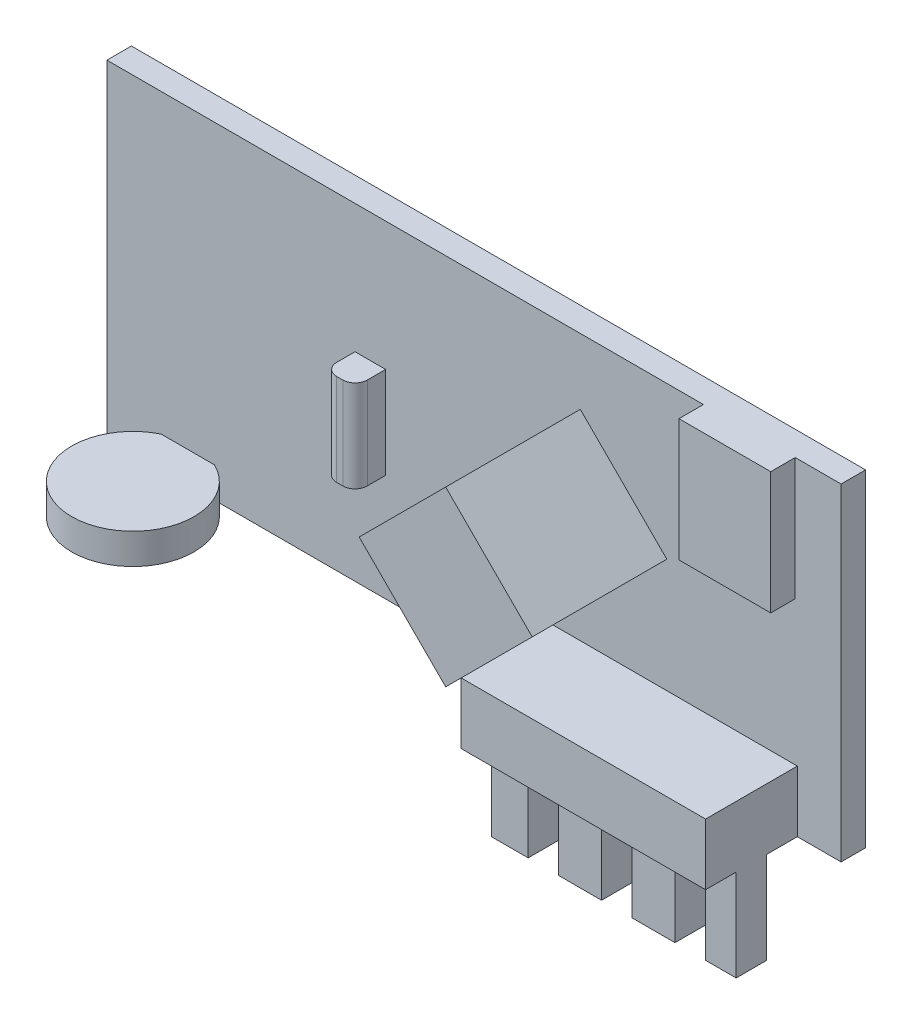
ISO-10303-21;
HEADER;
FILE_DESCRIPTION(('STEP AP214'),'2;1');
FILE_NAME('part.step','',(''),(''),'','','');
FILE_SCHEMA(('AUTOMOTIVE_DESIGN { 1 0 10303 214 1 1 1 1 }'));
ENDSEC;
DATA;
#1=APPLICATION_CONTEXT('core data for automotive mechanical design processes');
#2=APPLICATION_PROTOCOL_DEFINITION('international standard','automotive_design',2000,#1);
#3=PRODUCT_CONTEXT('',#1,'mechanical');
#4=PRODUCT('Part','Part','',(#3));
#5=PRODUCT_RELATED_PRODUCT_CATEGORY('part','',(#4));
#6=PRODUCT_DEFINITION_FORMATION('','',#4);
#7=PRODUCT_DEFINITION_CONTEXT('part definition',#1,'design');
#8=PRODUCT_DEFINITION('design','',#6,#7);
#9=PRODUCT_DEFINITION_SHAPE('','',#8);
#10=(LENGTH_UNIT() NAMED_UNIT(*) SI_UNIT(.MILLI.,.METRE.));
#11=(NAMED_UNIT(*) PLANE_ANGLE_UNIT() SI_UNIT($,.RADIAN.));
#12=(NAMED_UNIT(*) SI_UNIT($,.STERADIAN.) SOLID_ANGLE_UNIT());
#13=UNCERTAINTY_MEASURE_WITH_UNIT(LENGTH_MEASURE(1.E-05),#10,'distance_accuracy_value','');
#14=(GEOMETRIC_REPRESENTATION_CONTEXT(3) GLOBAL_UNCERTAINTY_ASSIGNED_CONTEXT((#13)) GLOBAL_UNIT_ASSIGNED_CONTEXT((#10,
#11,#12)) REPRESENTATION_CONTEXT('',''));
#15=CARTESIAN_POINT('',(0.,0.,0.));
#16=DIRECTION('',(0.,0.,1.));
#17=DIRECTION('',(1.,0.,0.));
#18=AXIS2_PLACEMENT_3D('',#15,#16,#17);
#19=CARTESIAN_POINT('',(0.,0.,1.016));
#20=DIRECTION('',(0.,0.,-1.));
#21=DIRECTION('',(-1.,0.,0.));
#22=AXIS2_PLACEMENT_3D('',#19,#20,#21);
#23=PLANE('',#22);
#24=DIRECTION('',(-1.,0.,0.));
#25=VECTOR('',#24,1.);
#26=CARTESIAN_POINT('',(0.,1.27,1.016));
#27=LINE('',#26,#25);
#28=CARTESIAN_POINT('',(4.46998130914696,1.27,1.016));
#29=VERTEX_POINT('',#28);
#30=CARTESIAN_POINT('',(2.2556606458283,1.27,1.016));
#31=VERTEX_POINT('',#30);
#32=EDGE_CURVE('E673',#29,#31,#27,.T.);
#33=ORIENTED_EDGE('',*,*,#32,.F.);
#34=DIRECTION('',(0.,-1.,0.));
#35=VECTOR('',#34,1.);
#36=CARTESIAN_POINT('',(4.46998130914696,1.27,1.016));
#37=LINE('',#36,#35);
#38=CARTESIAN_POINT('',(4.46998130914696,0.,1.016));
#39=VERTEX_POINT('',#38);
#40=EDGE_CURVE('E357',#29,#39,#37,.T.);
#41=ORIENTED_EDGE('',*,*,#40,.T.);
#42=DIRECTION('',(1.,0.,0.));
#43=VECTOR('',#42,1.);
#44=CARTESIAN_POINT('',(0.,0.,1.016));
#45=LINE('',#44,#43);
#46=CARTESIAN_POINT('',(18.5036867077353,0.,1.016));
#47=VERTEX_POINT('',#46);
#48=EDGE_CURVE('E611',#39,#47,#45,.T.);
#49=ORIENTED_EDGE('',*,*,#48,.T.);
#50=DIRECTION('',(0.,-1.,0.));
#51=VECTOR('',#50,1.);
#52=CARTESIAN_POINT('',(18.5036867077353,-3.81,1.016));
#53=LINE('',#52,#51);
#54=CARTESIAN_POINT('',(18.5036867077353,2.54,1.016));
#55=VERTEX_POINT('',#54);
#56=EDGE_CURVE('E476',#55,#47,#53,.T.);
#57=ORIENTED_EDGE('',*,*,#56,.F.);
#58=DIRECTION('',(-1.,0.,0.));
#59=VECTOR('',#58,1.);
#60=CARTESIAN_POINT('',(18.5036867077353,2.54,1.016));
#61=LINE('',#60,#59);
#62=CARTESIAN_POINT('',(28.6636867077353,2.54,1.016));
#63=VERTEX_POINT('',#62);
#64=EDGE_CURVE('E482',#63,#55,#61,.T.);
#65=ORIENTED_EDGE('',*,*,#64,.F.);
#66=DIRECTION('',(0.,1.,0.));
#67=VECTOR('',#66,1.);
#68=CARTESIAN_POINT('',(28.6636867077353,-3.81,1.016));
#69=LINE('',#68,#67);
#70=CARTESIAN_POINT('',(28.6636867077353,0.,1.016));
#71=VERTEX_POINT('',#70);
#72=EDGE_CURVE('E492',#71,#63,#69,.T.);
#73=ORIENTED_EDGE('',*,*,#72,.F.);
#74=CARTESIAN_POINT('',(30.48,0.,1.016));
#75=VERTEX_POINT('',#74);
#76=EDGE_CURVE('E605',#71,#75,#45,.T.);
#77=ORIENTED_EDGE('',*,*,#76,.T.);
#78=DIRECTION('',(0.,1.,0.));
#79=VECTOR('',#78,1.);
#80=CARTESIAN_POINT('',(30.48,0.,1.016));
#81=LINE('',#80,#79);
#82=CARTESIAN_POINT('',(30.48,13.589,1.016));
#83=VERTEX_POINT('',#82);
#84=EDGE_CURVE('E610',#75,#83,#81,.T.);
#85=ORIENTED_EDGE('',*,*,#84,.T.);
#86=DIRECTION('',(-1.,0.,0.));
#87=VECTOR('',#86,1.);
#88=CARTESIAN_POINT('',(0.,13.589,1.016));
#89=LINE('',#88,#87);
#90=CARTESIAN_POINT('',(28.575,13.589,1.016));
#91=VERTEX_POINT('',#90);
#92=EDGE_CURVE('E615',#83,#91,#89,.T.);
#93=ORIENTED_EDGE('',*,*,#92,.T.);
#94=DIRECTION('',(0.,1.,0.));
#95=VECTOR('',#94,1.);
#96=CARTESIAN_POINT('',(28.575,13.589,1.016));
#97=LINE('',#96,#95);
#98=CARTESIAN_POINT('',(28.575,8.509,1.016));
#99=VERTEX_POINT('',#98);
#100=EDGE_CURVE('E565',#99,#91,#97,.T.);
#101=ORIENTED_EDGE('',*,*,#100,.F.);
#102=DIRECTION('',(1.,0.,0.));
#103=VECTOR('',#102,1.);
#104=CARTESIAN_POINT('',(24.765,8.509,1.016));
#105=LINE('',#104,#103);
#106=CARTESIAN_POINT('',(24.765,8.509,1.016));
#107=VERTEX_POINT('',#106);
#108=EDGE_CURVE('E578',#107,#99,#105,.T.);
#109=ORIENTED_EDGE('',*,*,#108,.F.);
#110=DIRECTION('',(0.,-1.,0.));
#111=VECTOR('',#110,1.);
#112=CARTESIAN_POINT('',(24.765,13.589,1.016));
#113=LINE('',#112,#111);
#114=CARTESIAN_POINT('',(24.765,13.589,1.016));
#115=VERTEX_POINT('',#114);
#116=EDGE_CURVE('E559',#115,#107,#113,.T.);
#117=ORIENTED_EDGE('',*,*,#116,.F.);
#118=CARTESIAN_POINT('',(0.,13.589,1.016));
#119=VERTEX_POINT('',#118);
#120=EDGE_CURVE('E614',#115,#119,#89,.T.);
#121=ORIENTED_EDGE('',*,*,#120,.T.);
#122=DIRECTION('',(0.,-1.,0.));
#123=VECTOR('',#122,1.);
#124=CARTESIAN_POINT('',(0.,0.,1.016));
#125=LINE('',#124,#123);
#126=CARTESIAN_POINT('',(0.,0.,1.016));
#127=VERTEX_POINT('',#126);
#128=EDGE_CURVE('E601',#119,#127,#125,.T.);
#129=ORIENTED_EDGE('',*,*,#128,.T.);
#130=CARTESIAN_POINT('',(2.2556606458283,0.,1.016));
#131=VERTEX_POINT('',#130);
#132=EDGE_CURVE('E607',#127,#131,#45,.T.);
#133=ORIENTED_EDGE('',*,*,#132,.T.);
#134=DIRECTION('',(0.,-1.,0.));
#135=VECTOR('',#134,1.);
#136=CARTESIAN_POINT('',(2.2556606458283,1.27,1.016));
#137=LINE('',#136,#135);
#138=EDGE_CURVE('E351',#131,#31,#137,.F.);
#139=ORIENTED_EDGE('',*,*,#138,.T.);
#140=EDGE_LOOP('',(#33,#41,#49,#57,#65,#73,#77,#85,#93,#101,#109,#117,#121,#129,#133,#139));
#141=FACE_BOUND('',#140,.T.);
#142=DIRECTION('',(0.707106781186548,-0.707106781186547,0.));
#143=VECTOR('',#142,1.);
#144=CARTESIAN_POINT('',(16.0610746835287,7.2682871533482,1.016));
#145=LINE('',#144,#143);
#146=CARTESIAN_POINT('',(16.0610746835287,7.2682871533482,1.016));
#147=VERTEX_POINT('',#146);
#148=CARTESIAN_POINT('',(19.6531771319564,3.67618470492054,1.016));
#149=VERTEX_POINT('',#148);
#150=EDGE_CURVE('E514',#147,#149,#145,.T.);
#151=ORIENTED_EDGE('',*,*,#150,.F.);
#152=DIRECTION('',(-0.707106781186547,-0.707106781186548,0.));
#153=VECTOR('',#152,1.);
#154=CARTESIAN_POINT('',(19.6531771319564,10.8603896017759,1.016));
#155=LINE('',#154,#153);
#156=CARTESIAN_POINT('',(19.6531771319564,10.8603896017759,1.016));
#157=VERTEX_POINT('',#156);
#158=EDGE_CURVE('E520',#157,#147,#155,.T.);
#159=ORIENTED_EDGE('',*,*,#158,.F.);
#160=DIRECTION('',(-0.707106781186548,0.707106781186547,0.));
#161=VECTOR('',#160,1.);
#162=CARTESIAN_POINT('',(23.245279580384,7.2682871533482,1.016));
#163=LINE('',#162,#161);
#164=CARTESIAN_POINT('',(23.245279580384,7.2682871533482,1.016));
#165=VERTEX_POINT('',#164);
#166=EDGE_CURVE('E537',#165,#157,#163,.T.);
#167=ORIENTED_EDGE('',*,*,#166,.F.);
#168=DIRECTION('',(0.707106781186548,0.707106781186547,0.));
#169=VECTOR('',#168,1.);
#170=CARTESIAN_POINT('',(19.6531771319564,3.67618470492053,1.016));
#171=LINE('',#170,#169);
#172=EDGE_CURVE('E533',#149,#165,#171,.T.);
#173=ORIENTED_EDGE('',*,*,#172,.F.);
#174=EDGE_LOOP('',(#151,#159,#167,#173));
#175=FACE_BOUND('',#174,.T.);
#176=DIRECTION('',(0.,1.,0.));
#177=VECTOR('',#176,1.);
#178=CARTESIAN_POINT('',(11.5708707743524,8.255,1.016));
#179=LINE('',#178,#177);
#180=CARTESIAN_POINT('',(11.5708707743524,4.445,1.016));
#181=VERTEX_POINT('',#180);
#182=CARTESIAN_POINT('',(11.5708707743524,8.255,1.016));
#183=VERTEX_POINT('',#182);
#184=EDGE_CURVE('E306',#181,#183,#179,.T.);
#185=ORIENTED_EDGE('',*,*,#184,.F.);
#186=DIRECTION('',(1.,0.,0.));
#187=VECTOR('',#186,1.);
#188=CARTESIAN_POINT('',(10.3008707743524,4.445,1.016));
#189=LINE('',#188,#187);
#190=CARTESIAN_POINT('',(10.3008707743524,4.445,1.016));
#191=VERTEX_POINT('',#190);
#192=EDGE_CURVE('E319',#191,#181,#189,.T.);
#193=ORIENTED_EDGE('',*,*,#192,.F.);
#194=DIRECTION('',(0.,-1.,0.));
#195=VECTOR('',#194,1.);
#196=CARTESIAN_POINT('',(10.3008707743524,8.255,1.016));
#197=LINE('',#196,#195);
#198=CARTESIAN_POINT('',(10.3008707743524,8.255,1.016));
#199=VERTEX_POINT('',#198);
#200=EDGE_CURVE('E329',#199,#191,#197,.T.);
#201=ORIENTED_EDGE('',*,*,#200,.F.);
#202=DIRECTION('',(-1.,0.,0.));
#203=VECTOR('',#202,1.);
#204=CARTESIAN_POINT('',(10.3008707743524,8.255,1.016));
#205=LINE('',#204,#203);
#206=EDGE_CURVE('E322',#183,#199,#205,.T.);
#207=ORIENTED_EDGE('',*,*,#206,.F.);
#208=EDGE_LOOP('',(#185,#193,#201,#207));
#209=FACE_BOUND('',#208,.T.);
#210=ADVANCED_FACE('F45',(#141,#175,#209),#23,.F.);
#211=CARTESIAN_POINT('',(18.5036867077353,-3.81,4.826));
#212=DIRECTION('',(0.,1.,0.));
#213=DIRECTION('',(0.,0.,1.));
#214=AXIS2_PLACEMENT_3D('',#211,#212,#213);
#215=PLANE('',#214);
#216=DIRECTION('',(1.,0.,0.));
#217=VECTOR('',#216,1.);
#218=CARTESIAN_POINT('',(14.4396867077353,-3.81,2.286));
#219=LINE('',#218,#217);
#220=CARTESIAN_POINT('',(18.5036867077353,-3.81,2.286));
#221=VERTEX_POINT('',#220);
#222=CARTESIAN_POINT('',(20.0276867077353,-3.81,2.286));
#223=VERTEX_POINT('',#222);
#224=EDGE_CURVE('E450',#221,#223,#219,.T.);
#225=ORIENTED_EDGE('',*,*,#224,.T.);
#226=DIRECTION('',(0.,0.,1.));
#227=VECTOR('',#226,1.);
#228=CARTESIAN_POINT('',(20.0276867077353,-3.81,-10.668));
#229=LINE('',#228,#227);
#230=CARTESIAN_POINT('',(20.0276867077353,-3.81,3.556));
#231=VERTEX_POINT('',#230);
#232=EDGE_CURVE('E370',#223,#231,#229,.T.);
#233=ORIENTED_EDGE('',*,*,#232,.T.);
#234=DIRECTION('',(1.,0.,0.));
#235=VECTOR('',#234,1.);
#236=CARTESIAN_POINT('',(14.4396867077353,-3.81,3.556));
#237=LINE('',#236,#235);
#238=CARTESIAN_POINT('',(18.5036867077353,-3.81,3.556));
#239=VERTEX_POINT('',#238);
#240=EDGE_CURVE('E438',#239,#231,#237,.T.);
#241=ORIENTED_EDGE('',*,*,#240,.F.);
#242=DIRECTION('',(0.,0.,-1.));
#243=VECTOR('',#242,1.);
#244=CARTESIAN_POINT('',(18.5036867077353,-3.81,4.826));
#245=LINE('',#244,#243);
#246=EDGE_CURVE('E510',#239,#221,#245,.T.);
#247=ORIENTED_EDGE('',*,*,#246,.T.);
#248=EDGE_LOOP('',(#225,#233,#241,#247));
#249=FACE_BOUND('',#248,.T.);
#250=ADVANCED_FACE('F714',(#249),#215,.F.);
#251=CARTESIAN_POINT('',(21.2976867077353,-3.81,3.556));
#252=VERTEX_POINT('',#251);
#253=CARTESIAN_POINT('',(23.0756867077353,-3.81,3.556));
#254=VERTEX_POINT('',#253);
#255=EDGE_CURVE('E442',#252,#254,#237,.T.);
#256=ORIENTED_EDGE('',*,*,#255,.F.);
#257=DIRECTION('',(0.,0.,1.));
#258=VECTOR('',#257,1.);
#259=CARTESIAN_POINT('',(21.2976867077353,-3.81,-10.668));
#260=LINE('',#259,#258);
#261=CARTESIAN_POINT('',(21.2976867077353,-3.81,2.286));
#262=VERTEX_POINT('',#261);
#263=EDGE_CURVE('E378',#262,#252,#260,.T.);
#264=ORIENTED_EDGE('',*,*,#263,.F.);
#265=CARTESIAN_POINT('',(23.0756867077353,-3.81,2.286));
#266=VERTEX_POINT('',#265);
#267=EDGE_CURVE('E454',#262,#266,#219,.T.);
#268=ORIENTED_EDGE('',*,*,#267,.T.);
#269=DIRECTION('',(0.,0.,1.));
#270=VECTOR('',#269,1.);
#271=CARTESIAN_POINT('',(23.0756867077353,-3.81,-10.668));
#272=LINE('',#271,#270);
#273=EDGE_CURVE('E384',#266,#254,#272,.T.);
#274=ORIENTED_EDGE('',*,*,#273,.T.);
#275=EDGE_LOOP('',(#256,#264,#268,#274));
#276=FACE_BOUND('',#275,.T.);
#277=ADVANCED_FACE('F722',(#276),#215,.F.);
#278=CARTESIAN_POINT('',(24.3456867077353,-3.81,3.556));
#279=VERTEX_POINT('',#278);
#280=CARTESIAN_POINT('',(26.1236867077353,-3.81,3.556));
#281=VERTEX_POINT('',#280);
#282=EDGE_CURVE('E803',#279,#281,#237,.T.);
#283=ORIENTED_EDGE('',*,*,#282,.F.);
#284=DIRECTION('',(0.,0.,1.));
#285=VECTOR('',#284,1.);
#286=CARTESIAN_POINT('',(24.3456867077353,-3.81,-10.668));
#287=LINE('',#286,#285);
#288=CARTESIAN_POINT('',(24.3456867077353,-3.81,2.286));
#289=VERTEX_POINT('',#288);
#290=EDGE_CURVE('E389',#289,#279,#287,.T.);
#291=ORIENTED_EDGE('',*,*,#290,.F.);
#292=CARTESIAN_POINT('',(26.1236867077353,-3.81,2.286));
#293=VERTEX_POINT('',#292);
#294=EDGE_CURVE('E840',#289,#293,#219,.T.);
#295=ORIENTED_EDGE('',*,*,#294,.T.);
#296=DIRECTION('',(0.,0.,1.));
#297=VECTOR('',#296,1.);
#298=CARTESIAN_POINT('',(26.1236867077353,-3.81,-10.668));
#299=LINE('',#298,#297);
#300=EDGE_CURVE('E404',#293,#281,#299,.T.);
#301=ORIENTED_EDGE('',*,*,#300,.T.);
#302=EDGE_LOOP('',(#283,#291,#295,#301));
#303=FACE_BOUND('',#302,.T.);
#304=ADVANCED_FACE('F847',(#303),#215,.F.);
#305=CARTESIAN_POINT('',(14.4396867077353,-3.81,3.556));
#306=DIRECTION('',(0.,0.,-1.));
#307=DIRECTION('',(-1.,0.,0.));
#308=AXIS2_PLACEMENT_3D('',#305,#306,#307);
#309=PLANE('',#308);
#310=ORIENTED_EDGE('',*,*,#240,.T.);
#311=DIRECTION('',(0.,-1.,0.));
#312=VECTOR('',#311,1.);
#313=CARTESIAN_POINT('',(20.0276867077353,-3.81,3.556));
#314=LINE('',#313,#312);
#315=CARTESIAN_POINT('',(20.0276867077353,0.,3.556));
#316=VERTEX_POINT('',#315);
#317=EDGE_CURVE('E362',#316,#231,#314,.T.);
#318=ORIENTED_EDGE('',*,*,#317,.F.);
#319=DIRECTION('',(1.,0.,0.));
#320=VECTOR('',#319,1.);
#321=CARTESIAN_POINT('',(14.4396867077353,0.,3.556));
#322=LINE('',#321,#320);
#323=CARTESIAN_POINT('',(18.5036867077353,0.,3.556));
#324=VERTEX_POINT('',#323);
#325=EDGE_CURVE('E431',#324,#316,#322,.T.);
#326=ORIENTED_EDGE('',*,*,#325,.F.);
#327=DIRECTION('',(0.,1.,0.));
#328=VECTOR('',#327,1.);
#329=CARTESIAN_POINT('',(18.5036867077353,-3.81,3.556));
#330=LINE('',#329,#328);
#331=EDGE_CURVE('E472',#239,#324,#330,.T.);
#332=ORIENTED_EDGE('',*,*,#331,.F.);
#333=EDGE_LOOP('',(#310,#318,#326,#332));
#334=FACE_BOUND('',#333,.T.);
#335=ADVANCED_FACE('F884',(#334),#309,.F.);
#336=CARTESIAN_POINT('',(21.2976867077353,0.,3.556));
#337=VERTEX_POINT('',#336);
#338=CARTESIAN_POINT('',(23.0756867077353,0.,3.556));
#339=VERTEX_POINT('',#338);
#340=EDGE_CURVE('E436',#337,#339,#322,.T.);
#341=ORIENTED_EDGE('',*,*,#340,.F.);
#342=DIRECTION('',(0.,1.,0.));
#343=VECTOR('',#342,1.);
#344=CARTESIAN_POINT('',(21.2976867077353,-3.81,3.556));
#345=LINE('',#344,#343);
#346=EDGE_CURVE('E365',#252,#337,#345,.T.);
#347=ORIENTED_EDGE('',*,*,#346,.F.);
#348=ORIENTED_EDGE('',*,*,#255,.T.);
#349=DIRECTION('',(0.,-1.,0.));
#350=VECTOR('',#349,1.);
#351=CARTESIAN_POINT('',(23.0756867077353,-3.81,3.556));
#352=LINE('',#351,#350);
#353=EDGE_CURVE('E366',#339,#254,#352,.T.);
#354=ORIENTED_EDGE('',*,*,#353,.F.);
#355=EDGE_LOOP('',(#341,#347,#348,#354));
#356=FACE_BOUND('',#355,.T.);
#357=ADVANCED_FACE('F817',(#356),#309,.F.);
#358=CARTESIAN_POINT('',(24.3456867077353,0.,3.556));
#359=VERTEX_POINT('',#358);
#360=CARTESIAN_POINT('',(26.1236867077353,0.,3.556));
#361=VERTEX_POINT('',#360);
#362=EDGE_CURVE('E797',#359,#361,#322,.T.);
#363=ORIENTED_EDGE('',*,*,#362,.F.);
#364=DIRECTION('',(0.,1.,0.));
#365=VECTOR('',#364,1.);
#366=CARTESIAN_POINT('',(24.3456867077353,-3.81,3.556));
#367=LINE('',#366,#365);
#368=EDGE_CURVE('E388',#279,#359,#367,.T.);
#369=ORIENTED_EDGE('',*,*,#368,.F.);
#370=ORIENTED_EDGE('',*,*,#282,.T.);
#371=DIRECTION('',(0.,-1.,0.));
#372=VECTOR('',#371,1.);
#373=CARTESIAN_POINT('',(26.1236867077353,-3.81,3.556));
#374=LINE('',#373,#372);
#375=EDGE_CURVE('E398',#361,#281,#374,.T.);
#376=ORIENTED_EDGE('',*,*,#375,.F.);
#377=EDGE_LOOP('',(#363,#369,#370,#376));
#378=FACE_BOUND('',#377,.T.);
#379=ADVANCED_FACE('F885',(#378),#309,.F.);
#380=CARTESIAN_POINT('',(14.4396867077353,-3.81,2.286));
#381=DIRECTION('',(0.,0.,1.));
#382=DIRECTION('',(1.,0.,0.));
#383=AXIS2_PLACEMENT_3D('',#380,#381,#382);
#384=PLANE('',#383);
#385=DIRECTION('',(1.,0.,0.));
#386=VECTOR('',#385,1.);
#387=CARTESIAN_POINT('',(14.4396867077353,0.,2.286));
#388=LINE('',#387,#386);
#389=CARTESIAN_POINT('',(18.5036867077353,0.,2.286));
#390=VERTEX_POINT('',#389);
#391=CARTESIAN_POINT('',(20.0276867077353,0.,2.286));
#392=VERTEX_POINT('',#391);
#393=EDGE_CURVE('E443',#390,#392,#388,.T.);
#394=ORIENTED_EDGE('',*,*,#393,.T.);
#395=DIRECTION('',(0.,-1.,0.));
#396=VECTOR('',#395,1.);
#397=CARTESIAN_POINT('',(20.0276867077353,-3.81,2.286));
#398=LINE('',#397,#396);
#399=EDGE_CURVE('E669',#392,#223,#398,.T.);
#400=ORIENTED_EDGE('',*,*,#399,.T.);
#401=ORIENTED_EDGE('',*,*,#224,.F.);
#402=DIRECTION('',(0.,-1.,0.));
#403=VECTOR('',#402,1.);
#404=CARTESIAN_POINT('',(18.5036867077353,-3.81,2.286));
#405=LINE('',#404,#403);
#406=EDGE_CURVE('E468',#390,#221,#405,.T.);
#407=ORIENTED_EDGE('',*,*,#406,.F.);
#408=EDGE_LOOP('',(#394,#400,#401,#407));
#409=FACE_BOUND('',#408,.T.);
#410=ADVANCED_FACE('F888',(#409),#384,.F.);
#411=ORIENTED_EDGE('',*,*,#267,.F.);
#412=DIRECTION('',(0.,1.,0.));
#413=VECTOR('',#412,1.);
#414=CARTESIAN_POINT('',(21.2976867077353,-3.81,2.286));
#415=LINE('',#414,#413);
#416=CARTESIAN_POINT('',(21.2976867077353,0.,2.286));
#417=VERTEX_POINT('',#416);
#418=EDGE_CURVE('E665',#262,#417,#415,.T.);
#419=ORIENTED_EDGE('',*,*,#418,.T.);
#420=CARTESIAN_POINT('',(23.0756867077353,0.,2.286));
#421=VERTEX_POINT('',#420);
#422=EDGE_CURVE('E448',#417,#421,#388,.T.);
#423=ORIENTED_EDGE('',*,*,#422,.T.);
#424=DIRECTION('',(0.,-1.,0.));
#425=VECTOR('',#424,1.);
#426=CARTESIAN_POINT('',(23.0756867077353,-3.81,2.286));
#427=LINE('',#426,#425);
#428=EDGE_CURVE('E661',#421,#266,#427,.T.);
#429=ORIENTED_EDGE('',*,*,#428,.T.);
#430=EDGE_LOOP('',(#411,#419,#423,#429));
#431=FACE_BOUND('',#430,.T.);
#432=ADVANCED_FACE('F754',(#431),#384,.F.);
#433=ORIENTED_EDGE('',*,*,#294,.F.);
#434=DIRECTION('',(0.,1.,0.));
#435=VECTOR('',#434,1.);
#436=CARTESIAN_POINT('',(24.3456867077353,-3.81,2.286));
#437=LINE('',#436,#435);
#438=CARTESIAN_POINT('',(24.3456867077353,0.,2.286));
#439=VERTEX_POINT('',#438);
#440=EDGE_CURVE('E657',#289,#439,#437,.T.);
#441=ORIENTED_EDGE('',*,*,#440,.T.);
#442=CARTESIAN_POINT('',(26.1236867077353,0.,2.286));
#443=VERTEX_POINT('',#442);
#444=EDGE_CURVE('E830',#439,#443,#388,.T.);
#445=ORIENTED_EDGE('',*,*,#444,.T.);
#446=DIRECTION('',(0.,-1.,0.));
#447=VECTOR('',#446,1.);
#448=CARTESIAN_POINT('',(26.1236867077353,-3.81,2.286));
#449=LINE('',#448,#447);
#450=EDGE_CURVE('E653',#443,#293,#449,.T.);
#451=ORIENTED_EDGE('',*,*,#450,.T.);
#452=EDGE_LOOP('',(#433,#441,#445,#451));
#453=FACE_BOUND('',#452,.T.);
#454=ADVANCED_FACE('F749',(#453),#384,.F.);
#455=CARTESIAN_POINT('',(0.,0.,1.016));
#456=DIRECTION('',(1.,0.,0.));
#457=DIRECTION('',(0.,1.,0.));
#458=AXIS2_PLACEMENT_3D('',#455,#456,#457);
#459=PLANE('',#458);
#460=DIRECTION('',(0.,-1.,0.));
#461=VECTOR('',#460,1.);
#462=CARTESIAN_POINT('',(0.,0.,0.));
#463=LINE('',#462,#461);
#464=CARTESIAN_POINT('',(0.,13.589,0.));
#465=VERTEX_POINT('',#464);
#466=CARTESIAN_POINT('',(0.,0.,0.));
#467=VERTEX_POINT('',#466);
#468=EDGE_CURVE('E600',#465,#467,#463,.T.);
#469=ORIENTED_EDGE('',*,*,#468,.T.);
#470=DIRECTION('',(0.,0.,-1.));
#471=VECTOR('',#470,1.);
#472=CARTESIAN_POINT('',(0.,0.,1.016));
#473=LINE('',#472,#471);
#474=EDGE_CURVE('E641',#127,#467,#473,.T.);
#475=ORIENTED_EDGE('',*,*,#474,.F.);
#476=ORIENTED_EDGE('',*,*,#128,.F.);
#477=DIRECTION('',(0.,0.,-1.));
#478=VECTOR('',#477,1.);
#479=CARTESIAN_POINT('',(0.,13.589,1.016));
#480=LINE('',#479,#478);
#481=EDGE_CURVE('E618',#119,#465,#480,.T.);
#482=ORIENTED_EDGE('',*,*,#481,.T.);
#483=EDGE_LOOP('',(#469,#475,#476,#482));
#484=FACE_BOUND('',#483,.T.);
#485=ADVANCED_FACE('F746',(#484),#459,.F.);
#486=CARTESIAN_POINT('',(0.,0.,1.016));
#487=DIRECTION('',(0.,1.,0.));
#488=DIRECTION('',(0.,0.,1.));
#489=AXIS2_PLACEMENT_3D('',#486,#487,#488);
#490=PLANE('',#489);
#491=ORIENTED_EDGE('',*,*,#48,.F.);
#492=CARTESIAN_POINT('',(3.36282097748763,0.,3.302));
#493=DIRECTION('',(0.,-1.,0.));
#494=DIRECTION('',(0.,0.,-1.));
#495=AXIS2_PLACEMENT_3D('',#492,#493,#494);
#496=CIRCLE('',#495,2.54);
#497=EDGE_CURVE('E346',#39,#131,#496,.T.);
#498=ORIENTED_EDGE('',*,*,#497,.T.);
#499=ORIENTED_EDGE('',*,*,#132,.F.);
#500=ORIENTED_EDGE('',*,*,#474,.T.);
#501=DIRECTION('',(1.,0.,0.));
#502=VECTOR('',#501,1.);
#503=CARTESIAN_POINT('',(0.,0.,0.));
#504=LINE('',#503,#502);
#505=CARTESIAN_POINT('',(30.48,0.,0.));
#506=VERTEX_POINT('',#505);
#507=EDGE_CURVE('E622',#467,#506,#504,.T.);
#508=ORIENTED_EDGE('',*,*,#507,.T.);
#509=DIRECTION('',(0.,0.,-1.));
#510=VECTOR('',#509,1.);
#511=CARTESIAN_POINT('',(30.48,0.,1.016));
#512=LINE('',#511,#510);
#513=EDGE_CURVE('E637',#75,#506,#512,.T.);
#514=ORIENTED_EDGE('',*,*,#513,.F.);
#515=ORIENTED_EDGE('',*,*,#76,.F.);
#516=DIRECTION('',(0.,0.,1.));
#517=VECTOR('',#516,1.);
#518=CARTESIAN_POINT('',(28.6636867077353,0.,1.016));
#519=LINE('',#518,#517);
#520=CARTESIAN_POINT('',(28.6636867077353,0.,2.286));
#521=VERTEX_POINT('',#520);
#522=EDGE_CURVE('E427',#71,#521,#519,.T.);
#523=ORIENTED_EDGE('',*,*,#522,.T.);
#524=CARTESIAN_POINT('',(27.3936867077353,0.,2.286));
#525=VERTEX_POINT('',#524);
#526=EDGE_CURVE('E449',#525,#521,#388,.T.);
#527=ORIENTED_EDGE('',*,*,#526,.F.);
#528=DIRECTION('',(0.,0.,1.));
#529=VECTOR('',#528,1.);
#530=CARTESIAN_POINT('',(27.3936867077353,0.,-10.668));
#531=LINE('',#530,#529);
#532=CARTESIAN_POINT('',(27.3936867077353,0.,3.556));
#533=VERTEX_POINT('',#532);
#534=EDGE_CURVE('E412',#525,#533,#531,.T.);
#535=ORIENTED_EDGE('',*,*,#534,.T.);
#536=CARTESIAN_POINT('',(28.6636867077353,0.,3.556));
#537=VERTEX_POINT('',#536);
#538=EDGE_CURVE('E437',#533,#537,#322,.T.);
#539=ORIENTED_EDGE('',*,*,#538,.T.);
#540=DIRECTION('',(0.,0.,1.));
#541=VECTOR('',#540,1.);
#542=CARTESIAN_POINT('',(28.6636867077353,0.,4.826));
#543=LINE('',#542,#541);
#544=CARTESIAN_POINT('',(28.6636867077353,0.,4.826));
#545=VERTEX_POINT('',#544);
#546=EDGE_CURVE('E426',#537,#545,#543,.T.);
#547=ORIENTED_EDGE('',*,*,#546,.T.);
#548=DIRECTION('',(1.,0.,0.));
#549=VECTOR('',#548,1.);
#550=CARTESIAN_POINT('',(0.,0.,4.826));
#551=LINE('',#550,#549);
#552=CARTESIAN_POINT('',(18.5036867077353,0.,4.826));
#553=VERTEX_POINT('',#552);
#554=EDGE_CURVE('E645',#553,#545,#551,.T.);
#555=ORIENTED_EDGE('',*,*,#554,.F.);
#556=DIRECTION('',(0.,0.,1.));
#557=VECTOR('',#556,1.);
#558=CARTESIAN_POINT('',(18.5036867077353,0.,4.826));
#559=LINE('',#558,#557);
#560=EDGE_CURVE('E435',#324,#553,#559,.T.);
#561=ORIENTED_EDGE('',*,*,#560,.F.);
#562=ORIENTED_EDGE('',*,*,#325,.T.);
#563=DIRECTION('',(0.,0.,1.));
#564=VECTOR('',#563,1.);
#565=CARTESIAN_POINT('',(20.0276867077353,0.,-10.668));
#566=LINE('',#565,#564);
#567=EDGE_CURVE('E371',#392,#316,#566,.T.);
#568=ORIENTED_EDGE('',*,*,#567,.F.);
#569=ORIENTED_EDGE('',*,*,#393,.F.);
#570=DIRECTION('',(0.,0.,1.));
#571=VECTOR('',#570,1.);
#572=CARTESIAN_POINT('',(18.5036867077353,0.,4.826));
#573=LINE('',#572,#571);
#574=EDGE_CURVE('E464',#47,#390,#573,.T.);
#575=ORIENTED_EDGE('',*,*,#574,.F.);
#576=EDGE_LOOP('',(#491,#498,#499,#500,#508,#514,#515,#523,#527,#535,#539,#547,#555,#561,#562,
#568,#569,#575));
#577=FACE_BOUND('',#576,.T.);
#578=ORIENTED_EDGE('',*,*,#422,.F.);
#579=DIRECTION('',(0.,0.,1.));
#580=VECTOR('',#579,1.);
#581=CARTESIAN_POINT('',(21.2976867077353,0.,-10.668));
#582=LINE('',#581,#580);
#583=EDGE_CURVE('E375',#417,#337,#582,.T.);
#584=ORIENTED_EDGE('',*,*,#583,.T.);
#585=ORIENTED_EDGE('',*,*,#340,.T.);
#586=DIRECTION('',(0.,0.,1.));
#587=VECTOR('',#586,1.);
#588=CARTESIAN_POINT('',(23.0756867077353,0.,-10.668));
#589=LINE('',#588,#587);
#590=EDGE_CURVE('E395',#421,#339,#589,.T.);
#591=ORIENTED_EDGE('',*,*,#590,.F.);
#592=EDGE_LOOP('',(#578,#584,#585,#591));
#593=FACE_BOUND('',#592,.T.);
#594=ORIENTED_EDGE('',*,*,#444,.F.);
#595=DIRECTION('',(0.,0.,1.));
#596=VECTOR('',#595,1.);
#597=CARTESIAN_POINT('',(24.3456867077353,0.,-10.668));
#598=LINE('',#597,#596);
#599=EDGE_CURVE('E392',#439,#359,#598,.T.);
#600=ORIENTED_EDGE('',*,*,#599,.T.);
#601=ORIENTED_EDGE('',*,*,#362,.T.);
#602=DIRECTION('',(0.,0.,1.));
#603=VECTOR('',#602,1.);
#604=CARTESIAN_POINT('',(26.1236867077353,0.,-10.668));
#605=LINE('',#604,#603);
#606=EDGE_CURVE('E361',#443,#361,#605,.T.);
#607=ORIENTED_EDGE('',*,*,#606,.F.);
#608=EDGE_LOOP('',(#594,#600,#601,#607));
#609=FACE_BOUND('',#608,.T.);
#610=ADVANCED_FACE('F742',(#577,#593,#609),#490,.F.);
#611=CARTESIAN_POINT('',(30.48,0.,1.016));
#612=DIRECTION('',(-1.,0.,0.));
#613=DIRECTION('',(0.,-1.,0.));
#614=AXIS2_PLACEMENT_3D('',#611,#612,#613);
#615=PLANE('',#614);
#616=DIRECTION('',(0.,1.,0.));
#617=VECTOR('',#616,1.);
#618=CARTESIAN_POINT('',(30.48,0.,0.));
#619=LINE('',#618,#617);
#620=CARTESIAN_POINT('',(30.48,13.589,0.));
#621=VERTEX_POINT('',#620);
#622=EDGE_CURVE('E625',#506,#621,#619,.T.);
#623=ORIENTED_EDGE('',*,*,#622,.T.);
#624=DIRECTION('',(0.,0.,-1.));
#625=VECTOR('',#624,1.);
#626=CARTESIAN_POINT('',(30.48,13.589,1.016));
#627=LINE('',#626,#625);
#628=EDGE_CURVE('E633',#83,#621,#627,.T.);
#629=ORIENTED_EDGE('',*,*,#628,.F.);
#630=ORIENTED_EDGE('',*,*,#84,.F.);
#631=ORIENTED_EDGE('',*,*,#513,.T.);
#632=EDGE_LOOP('',(#623,#629,#630,#631));
#633=FACE_BOUND('',#632,.T.);
#634=ADVANCED_FACE('F738',(#633),#615,.F.);
#635=CARTESIAN_POINT('',(0.,13.589,1.016));
#636=DIRECTION('',(0.,-1.,0.));
#637=DIRECTION('',(0.,0.,-1.));
#638=AXIS2_PLACEMENT_3D('',#635,#636,#637);
#639=PLANE('',#638);
#640=DIRECTION('',(-1.,0.,0.));
#641=VECTOR('',#640,1.);
#642=CARTESIAN_POINT('',(0.,13.589,0.));
#643=LINE('',#642,#641);
#644=EDGE_CURVE('E606',#621,#465,#643,.T.);
#645=ORIENTED_EDGE('',*,*,#644,.T.);
#646=ORIENTED_EDGE('',*,*,#481,.F.);
#647=ORIENTED_EDGE('',*,*,#120,.F.);
#648=DIRECTION('',(0.,0.,-1.));
#649=VECTOR('',#648,1.);
#650=CARTESIAN_POINT('',(24.765,13.589,2.032));
#651=LINE('',#650,#649);
#652=CARTESIAN_POINT('',(24.765,13.589,2.032));
#653=VERTEX_POINT('',#652);
#654=EDGE_CURVE('E574',#653,#115,#651,.T.);
#655=ORIENTED_EDGE('',*,*,#654,.F.);
#656=DIRECTION('',(-1.,0.,0.));
#657=VECTOR('',#656,1.);
#658=CARTESIAN_POINT('',(24.765,13.589,2.032));
#659=LINE('',#658,#657);
#660=CARTESIAN_POINT('',(28.575,13.589,2.032));
#661=VERTEX_POINT('',#660);
#662=EDGE_CURVE('E571',#661,#653,#659,.T.);
#663=ORIENTED_EDGE('',*,*,#662,.F.);
#664=DIRECTION('',(0.,0.,-1.));
#665=VECTOR('',#664,1.);
#666=CARTESIAN_POINT('',(28.575,13.589,2.032));
#667=LINE('',#666,#665);
#668=EDGE_CURVE('E588',#661,#91,#667,.T.);
#669=ORIENTED_EDGE('',*,*,#668,.T.);
#670=ORIENTED_EDGE('',*,*,#92,.F.);
#671=ORIENTED_EDGE('',*,*,#628,.T.);
#672=EDGE_LOOP('',(#645,#646,#647,#655,#663,#669,#670,#671));
#673=FACE_BOUND('',#672,.T.);
#674=ADVANCED_FACE('F734',(#673),#639,.F.);
#675=CARTESIAN_POINT('',(0.,0.,0.));
#676=DIRECTION('',(0.,0.,-1.));
#677=DIRECTION('',(-1.,0.,0.));
#678=AXIS2_PLACEMENT_3D('',#675,#676,#677);
#679=PLANE('',#678);
#680=ORIENTED_EDGE('',*,*,#468,.F.);
#681=ORIENTED_EDGE('',*,*,#644,.F.);
#682=ORIENTED_EDGE('',*,*,#622,.F.);
#683=ORIENTED_EDGE('',*,*,#507,.F.);
#684=EDGE_LOOP('',(#680,#681,#682,#683));
#685=FACE_BOUND('',#684,.T.);
#686=ADVANCED_FACE('F731',(#685),#679,.T.);
#687=CARTESIAN_POINT('',(24.765,13.589,2.032));
#688=DIRECTION('',(1.,0.,0.));
#689=DIRECTION('',(0.,1.,0.));
#690=AXIS2_PLACEMENT_3D('',#687,#688,#689);
#691=PLANE('',#690);
#692=ORIENTED_EDGE('',*,*,#116,.T.);
#693=DIRECTION('',(0.,0.,-1.));
#694=VECTOR('',#693,1.);
#695=CARTESIAN_POINT('',(24.765,8.509,2.032));
#696=LINE('',#695,#694);
#697=CARTESIAN_POINT('',(24.765,8.509,2.032));
#698=VERTEX_POINT('',#697);
#699=EDGE_CURVE('E596',#698,#107,#696,.T.);
#700=ORIENTED_EDGE('',*,*,#699,.F.);
#701=DIRECTION('',(0.,-1.,0.));
#702=VECTOR('',#701,1.);
#703=CARTESIAN_POINT('',(24.765,13.589,2.032));
#704=LINE('',#703,#702);
#705=EDGE_CURVE('E560',#653,#698,#704,.T.);
#706=ORIENTED_EDGE('',*,*,#705,.F.);
#707=ORIENTED_EDGE('',*,*,#654,.T.);
#708=EDGE_LOOP('',(#692,#700,#706,#707));
#709=FACE_BOUND('',#708,.T.);
#710=ADVANCED_FACE('F729',(#709),#691,.F.);
#711=CARTESIAN_POINT('',(24.765,8.509,2.032));
#712=DIRECTION('',(0.,1.,0.));
#713=DIRECTION('',(0.,0.,1.));
#714=AXIS2_PLACEMENT_3D('',#711,#712,#713);
#715=PLANE('',#714);
#716=ORIENTED_EDGE('',*,*,#108,.T.);
#717=DIRECTION('',(0.,0.,-1.));
#718=VECTOR('',#717,1.);
#719=CARTESIAN_POINT('',(28.575,8.509,2.032));
#720=LINE('',#719,#718);
#721=CARTESIAN_POINT('',(28.575,8.509,2.032));
#722=VERTEX_POINT('',#721);
#723=EDGE_CURVE('E592',#722,#99,#720,.T.);
#724=ORIENTED_EDGE('',*,*,#723,.F.);
#725=DIRECTION('',(1.,0.,0.));
#726=VECTOR('',#725,1.);
#727=CARTESIAN_POINT('',(24.765,8.509,2.032));
#728=LINE('',#727,#726);
#729=EDGE_CURVE('E564',#698,#722,#728,.T.);
#730=ORIENTED_EDGE('',*,*,#729,.F.);
#731=ORIENTED_EDGE('',*,*,#699,.T.);
#732=EDGE_LOOP('',(#716,#724,#730,#731));
#733=FACE_BOUND('',#732,.T.);
#734=ADVANCED_FACE('F926',(#733),#715,.F.);
#735=CARTESIAN_POINT('',(28.575,13.589,2.032));
#736=DIRECTION('',(-1.,0.,0.));
#737=DIRECTION('',(0.,0.,1.));
#738=AXIS2_PLACEMENT_3D('',#735,#736,#737);
#739=PLANE('',#738);
#740=ORIENTED_EDGE('',*,*,#100,.T.);
#741=ORIENTED_EDGE('',*,*,#668,.F.);
#742=DIRECTION('',(0.,1.,0.));
#743=VECTOR('',#742,1.);
#744=CARTESIAN_POINT('',(28.575,13.589,2.032));
#745=LINE('',#744,#743);
#746=EDGE_CURVE('E568',#722,#661,#745,.T.);
#747=ORIENTED_EDGE('',*,*,#746,.F.);
#748=ORIENTED_EDGE('',*,*,#723,.T.);
#749=EDGE_LOOP('',(#740,#741,#747,#748));
#750=FACE_BOUND('',#749,.T.);
#751=ADVANCED_FACE('F923',(#750),#739,.F.);
#752=CARTESIAN_POINT('',(0.,0.,2.032));
#753=DIRECTION('',(0.,0.,1.));
#754=DIRECTION('',(1.,0.,0.));
#755=AXIS2_PLACEMENT_3D('',#752,#753,#754);
#756=PLANE('',#755);
#757=ORIENTED_EDGE('',*,*,#705,.T.);
#758=ORIENTED_EDGE('',*,*,#729,.T.);
#759=ORIENTED_EDGE('',*,*,#746,.T.);
#760=ORIENTED_EDGE('',*,*,#662,.T.);
#761=EDGE_LOOP('',(#757,#758,#759,#760));
#762=FACE_BOUND('',#761,.T.);
#763=ADVANCED_FACE('F919',(#762),#756,.T.);
#764=CARTESIAN_POINT('',(16.0610746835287,7.2682871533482,6.604));
#765=DIRECTION('',(0.707106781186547,0.707106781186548,0.));
#766=DIRECTION('',(-0.707106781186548,0.707106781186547,0.));
#767=AXIS2_PLACEMENT_3D('',#764,#765,#766);
#768=PLANE('',#767);
#769=ORIENTED_EDGE('',*,*,#150,.T.);
#770=DIRECTION('',(0.,0.,-1.));
#771=VECTOR('',#770,1.);
#772=CARTESIAN_POINT('',(19.6531771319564,3.67618470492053,6.604));
#773=LINE('',#772,#771);
#774=CARTESIAN_POINT('',(19.6531771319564,3.67618470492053,6.604));
#775=VERTEX_POINT('',#774);
#776=EDGE_CURVE('E555',#775,#149,#773,.T.);
#777=ORIENTED_EDGE('',*,*,#776,.F.);
#778=DIRECTION('',(0.707106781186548,-0.707106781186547,0.));
#779=VECTOR('',#778,1.);
#780=CARTESIAN_POINT('',(16.0610746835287,7.2682871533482,6.604));
#781=LINE('',#780,#779);
#782=CARTESIAN_POINT('',(16.0610746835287,7.2682871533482,6.604));
#783=VERTEX_POINT('',#782);
#784=EDGE_CURVE('E515',#783,#775,#781,.T.);
#785=ORIENTED_EDGE('',*,*,#784,.F.);
#786=DIRECTION('',(0.,0.,-1.));
#787=VECTOR('',#786,1.);
#788=CARTESIAN_POINT('',(16.0610746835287,7.2682871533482,6.604));
#789=LINE('',#788,#787);
#790=EDGE_CURVE('E529',#783,#147,#789,.T.);
#791=ORIENTED_EDGE('',*,*,#790,.T.);
#792=EDGE_LOOP('',(#769,#777,#785,#791));
#793=FACE_BOUND('',#792,.T.);
#794=ADVANCED_FACE('F915',(#793),#768,.F.);
#795=CARTESIAN_POINT('',(19.6531771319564,3.67618470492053,6.604));
#796=DIRECTION('',(-0.707106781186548,0.707106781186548,0.));
#797=DIRECTION('',(-0.707106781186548,-0.707106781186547,0.));
#798=AXIS2_PLACEMENT_3D('',#795,#796,#797);
#799=PLANE('',#798);
#800=ORIENTED_EDGE('',*,*,#172,.T.);
#801=DIRECTION('',(0.,0.,-1.));
#802=VECTOR('',#801,1.);
#803=CARTESIAN_POINT('',(23.245279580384,7.2682871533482,6.604));
#804=LINE('',#803,#802);
#805=CARTESIAN_POINT('',(23.245279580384,7.2682871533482,6.604));
#806=VERTEX_POINT('',#805);
#807=EDGE_CURVE('E551',#806,#165,#804,.T.);
#808=ORIENTED_EDGE('',*,*,#807,.F.);
#809=DIRECTION('',(0.707106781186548,0.707106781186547,0.));
#810=VECTOR('',#809,1.);
#811=CARTESIAN_POINT('',(19.6531771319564,3.67618470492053,6.604));
#812=LINE('',#811,#810);
#813=EDGE_CURVE('E519',#775,#806,#812,.T.);
#814=ORIENTED_EDGE('',*,*,#813,.F.);
#815=ORIENTED_EDGE('',*,*,#776,.T.);
#816=EDGE_LOOP('',(#800,#808,#814,#815));
#817=FACE_BOUND('',#816,.T.);
#818=ADVANCED_FACE('F911',(#817),#799,.F.);
#819=CARTESIAN_POINT('',(23.245279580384,7.2682871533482,6.604));
#820=DIRECTION('',(-0.707106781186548,-0.707106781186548,0.));
#821=DIRECTION('',(0.707106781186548,-0.707106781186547,0.));
#822=AXIS2_PLACEMENT_3D('',#819,#820,#821);
#823=PLANE('',#822);
#824=ORIENTED_EDGE('',*,*,#166,.T.);
#825=DIRECTION('',(0.,0.,-1.));
#826=VECTOR('',#825,1.);
#827=CARTESIAN_POINT('',(19.6531771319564,10.8603896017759,6.604));
#828=LINE('',#827,#826);
#829=CARTESIAN_POINT('',(19.6531771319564,10.8603896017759,6.604));
#830=VERTEX_POINT('',#829);
#831=EDGE_CURVE('E547',#830,#157,#828,.T.);
#832=ORIENTED_EDGE('',*,*,#831,.F.);
#833=DIRECTION('',(-0.707106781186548,0.707106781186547,0.));
#834=VECTOR('',#833,1.);
#835=CARTESIAN_POINT('',(23.245279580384,7.2682871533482,6.604));
#836=LINE('',#835,#834);
#837=EDGE_CURVE('E523',#806,#830,#836,.T.);
#838=ORIENTED_EDGE('',*,*,#837,.F.);
#839=ORIENTED_EDGE('',*,*,#807,.T.);
#840=EDGE_LOOP('',(#824,#832,#838,#839));
#841=FACE_BOUND('',#840,.T.);
#842=ADVANCED_FACE('F907',(#841),#823,.F.);
#843=CARTESIAN_POINT('',(19.6531771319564,10.8603896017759,6.604));
#844=DIRECTION('',(0.707106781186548,-0.707106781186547,0.));
#845=DIRECTION('',(0.707106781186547,0.707106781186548,0.));
#846=AXIS2_PLACEMENT_3D('',#843,#844,#845);
#847=PLANE('',#846);
#848=ORIENTED_EDGE('',*,*,#158,.T.);
#849=ORIENTED_EDGE('',*,*,#790,.F.);
#850=DIRECTION('',(-0.707106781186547,-0.707106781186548,0.));
#851=VECTOR('',#850,1.);
#852=CARTESIAN_POINT('',(19.6531771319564,10.8603896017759,6.604));
#853=LINE('',#852,#851);
#854=EDGE_CURVE('E526',#830,#783,#853,.T.);
#855=ORIENTED_EDGE('',*,*,#854,.F.);
#856=ORIENTED_EDGE('',*,*,#831,.T.);
#857=EDGE_LOOP('',(#848,#849,#855,#856));
#858=FACE_BOUND('',#857,.T.);
#859=ADVANCED_FACE('F903',(#858),#847,.F.);
#860=CARTESIAN_POINT('',(0.,0.,6.604));
#861=DIRECTION('',(0.,0.,1.));
#862=DIRECTION('',(1.,0.,0.));
#863=AXIS2_PLACEMENT_3D('',#860,#861,#862);
#864=PLANE('',#863);
#865=ORIENTED_EDGE('',*,*,#784,.T.);
#866=ORIENTED_EDGE('',*,*,#813,.T.);
#867=ORIENTED_EDGE('',*,*,#837,.T.);
#868=ORIENTED_EDGE('',*,*,#854,.T.);
#869=EDGE_LOOP('',(#865,#866,#867,#868));
#870=FACE_BOUND('',#869,.T.);
#871=ADVANCED_FACE('F899',(#870),#864,.T.);
#872=CARTESIAN_POINT('',(18.5036867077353,-3.81,4.826));
#873=DIRECTION('',(1.,0.,0.));
#874=DIRECTION('',(0.,0.,-1.));
#875=AXIS2_PLACEMENT_3D('',#872,#873,#874);
#876=PLANE('',#875);
#877=ORIENTED_EDGE('',*,*,#331,.T.);
#878=ORIENTED_EDGE('',*,*,#560,.T.);
#879=DIRECTION('',(0.,-1.,0.));
#880=VECTOR('',#879,1.);
#881=CARTESIAN_POINT('',(18.5036867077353,-3.81,4.826));
#882=LINE('',#881,#880);
#883=CARTESIAN_POINT('',(18.5036867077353,2.54,4.826));
#884=VERTEX_POINT('',#883);
#885=EDGE_CURVE('E477',#884,#553,#882,.T.);
#886=ORIENTED_EDGE('',*,*,#885,.F.);
#887=DIRECTION('',(0.,0.,-1.));
#888=VECTOR('',#887,1.);
#889=CARTESIAN_POINT('',(18.5036867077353,2.54,4.826));
#890=LINE('',#889,#888);
#891=EDGE_CURVE('E488',#884,#55,#890,.T.);
#892=ORIENTED_EDGE('',*,*,#891,.T.);
#893=ORIENTED_EDGE('',*,*,#56,.T.);
#894=ORIENTED_EDGE('',*,*,#574,.T.);
#895=ORIENTED_EDGE('',*,*,#406,.T.);
#896=ORIENTED_EDGE('',*,*,#246,.F.);
#897=EDGE_LOOP('',(#877,#878,#886,#892,#893,#894,#895,#896));
#898=FACE_BOUND('',#897,.T.);
#899=ADVANCED_FACE('F896',(#898),#876,.F.);
#900=CARTESIAN_POINT('',(27.3936867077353,-3.81,3.556));
#901=VERTEX_POINT('',#900);
#902=CARTESIAN_POINT('',(28.6636867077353,-3.81,3.556));
#903=VERTEX_POINT('',#902);
#904=EDGE_CURVE('E430',#901,#903,#237,.T.);
#905=ORIENTED_EDGE('',*,*,#904,.F.);
#906=DIRECTION('',(0.,0.,1.));
#907=VECTOR('',#906,1.);
#908=CARTESIAN_POINT('',(27.3936867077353,-3.81,-10.668));
#909=LINE('',#908,#907);
#910=CARTESIAN_POINT('',(27.3936867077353,-3.81,2.286));
#911=VERTEX_POINT('',#910);
#912=EDGE_CURVE('E409',#911,#901,#909,.T.);
#913=ORIENTED_EDGE('',*,*,#912,.F.);
#914=CARTESIAN_POINT('',(28.6636867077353,-3.81,2.286));
#915=VERTEX_POINT('',#914);
#916=EDGE_CURVE('E374',#911,#915,#219,.T.);
#917=ORIENTED_EDGE('',*,*,#916,.T.);
#918=DIRECTION('',(0.,0.,-1.));
#919=VECTOR('',#918,1.);
#920=CARTESIAN_POINT('',(28.6636867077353,-3.81,4.826));
#921=LINE('',#920,#919);
#922=EDGE_CURVE('E506',#903,#915,#921,.T.);
#923=ORIENTED_EDGE('',*,*,#922,.F.);
#924=EDGE_LOOP('',(#905,#913,#917,#923));
#925=FACE_BOUND('',#924,.T.);
#926=ADVANCED_FACE('F725',(#925),#215,.F.);
#927=CARTESIAN_POINT('',(28.6636867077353,-3.81,4.826));
#928=DIRECTION('',(-1.,0.,0.));
#929=DIRECTION('',(0.,0.,1.));
#930=AXIS2_PLACEMENT_3D('',#927,#928,#929);
#931=PLANE('',#930);
#932=DIRECTION('',(0.,1.,0.));
#933=VECTOR('',#932,1.);
#934=CARTESIAN_POINT('',(28.6636867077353,-3.81,4.826));
#935=LINE('',#934,#933);
#936=CARTESIAN_POINT('',(28.6636867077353,2.54,4.826));
#937=VERTEX_POINT('',#936);
#938=EDGE_CURVE('E481',#545,#937,#935,.T.);
#939=ORIENTED_EDGE('',*,*,#938,.F.);
#940=ORIENTED_EDGE('',*,*,#546,.F.);
#941=DIRECTION('',(0.,1.,0.));
#942=VECTOR('',#941,1.);
#943=CARTESIAN_POINT('',(28.6636867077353,-3.81,3.556));
#944=LINE('',#943,#942);
#945=EDGE_CURVE('E422',#903,#537,#944,.T.);
#946=ORIENTED_EDGE('',*,*,#945,.F.);
#947=ORIENTED_EDGE('',*,*,#922,.T.);
#948=DIRECTION('',(0.,-1.,0.));
#949=VECTOR('',#948,1.);
#950=CARTESIAN_POINT('',(28.6636867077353,-3.81,2.286));
#951=LINE('',#950,#949);
#952=EDGE_CURVE('E447',#521,#915,#951,.T.);
#953=ORIENTED_EDGE('',*,*,#952,.F.);
#954=ORIENTED_EDGE('',*,*,#522,.F.);
#955=ORIENTED_EDGE('',*,*,#72,.T.);
#956=DIRECTION('',(0.,0.,-1.));
#957=VECTOR('',#956,1.);
#958=CARTESIAN_POINT('',(28.6636867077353,2.54,4.826));
#959=LINE('',#958,#957);
#960=EDGE_CURVE('E502',#937,#63,#959,.T.);
#961=ORIENTED_EDGE('',*,*,#960,.F.);
#962=EDGE_LOOP('',(#939,#940,#946,#947,#953,#954,#955,#961));
#963=FACE_BOUND('',#962,.T.);
#964=ADVANCED_FACE('F782',(#963),#931,.F.);
#965=CARTESIAN_POINT('',(18.5036867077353,2.54,4.826));
#966=DIRECTION('',(0.,-1.,0.));
#967=DIRECTION('',(0.,0.,-1.));
#968=AXIS2_PLACEMENT_3D('',#965,#966,#967);
#969=PLANE('',#968);
#970=ORIENTED_EDGE('',*,*,#64,.T.);
#971=ORIENTED_EDGE('',*,*,#891,.F.);
#972=DIRECTION('',(-1.,0.,0.));
#973=VECTOR('',#972,1.);
#974=CARTESIAN_POINT('',(18.5036867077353,2.54,4.826));
#975=LINE('',#974,#973);
#976=EDGE_CURVE('E485',#937,#884,#975,.T.);
#977=ORIENTED_EDGE('',*,*,#976,.F.);
#978=ORIENTED_EDGE('',*,*,#960,.T.);
#979=EDGE_LOOP('',(#970,#971,#977,#978));
#980=FACE_BOUND('',#979,.T.);
#981=ADVANCED_FACE('F785',(#980),#969,.F.);
#982=CARTESIAN_POINT('',(0.,0.,4.826));
#983=DIRECTION('',(0.,0.,-1.));
#984=DIRECTION('',(-1.,0.,0.));
#985=AXIS2_PLACEMENT_3D('',#982,#983,#984);
#986=PLANE('',#985);
#987=ORIENTED_EDGE('',*,*,#885,.T.);
#988=ORIENTED_EDGE('',*,*,#554,.T.);
#989=ORIENTED_EDGE('',*,*,#938,.T.);
#990=ORIENTED_EDGE('',*,*,#976,.T.);
#991=EDGE_LOOP('',(#987,#988,#989,#990));
#992=FACE_BOUND('',#991,.T.);
#993=ADVANCED_FACE('F789',(#992),#986,.F.);
#994=ORIENTED_EDGE('',*,*,#538,.F.);
#995=DIRECTION('',(0.,1.,0.));
#996=VECTOR('',#995,1.);
#997=CARTESIAN_POINT('',(27.3936867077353,-3.81,3.556));
#998=LINE('',#997,#996);
#999=EDGE_CURVE('E408',#901,#533,#998,.T.);
#1000=ORIENTED_EDGE('',*,*,#999,.F.);
#1001=ORIENTED_EDGE('',*,*,#904,.T.);
#1002=ORIENTED_EDGE('',*,*,#945,.T.);
#1003=EDGE_LOOP('',(#994,#1000,#1001,#1002));
#1004=FACE_BOUND('',#1003,.T.);
#1005=ADVANCED_FACE('F798',(#1004),#309,.F.);
#1006=ORIENTED_EDGE('',*,*,#916,.F.);
#1007=DIRECTION('',(0.,1.,0.));
#1008=VECTOR('',#1007,1.);
#1009=CARTESIAN_POINT('',(27.3936867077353,-3.81,2.286));
#1010=LINE('',#1009,#1008);
#1011=EDGE_CURVE('E649',#911,#525,#1010,.T.);
#1012=ORIENTED_EDGE('',*,*,#1011,.T.);
#1013=ORIENTED_EDGE('',*,*,#526,.T.);
#1014=ORIENTED_EDGE('',*,*,#952,.T.);
#1015=EDGE_LOOP('',(#1006,#1012,#1013,#1014));
#1016=FACE_BOUND('',#1015,.T.);
#1017=ADVANCED_FACE('F757',(#1016),#384,.F.);
#1018=CARTESIAN_POINT('',(26.1236867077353,-3.81,-10.668));
#1019=DIRECTION('',(-1.,0.,0.));
#1020=DIRECTION('',(0.,0.,1.));
#1021=AXIS2_PLACEMENT_3D('',#1018,#1019,#1020);
#1022=PLANE('',#1021);
#1023=ORIENTED_EDGE('',*,*,#606,.T.);
#1024=ORIENTED_EDGE('',*,*,#375,.T.);
#1025=ORIENTED_EDGE('',*,*,#300,.F.);
#1026=ORIENTED_EDGE('',*,*,#450,.F.);
#1027=EDGE_LOOP('',(#1023,#1024,#1025,#1026));
#1028=FACE_BOUND('',#1027,.T.);
#1029=ADVANCED_FACE('F850',(#1028),#1022,.F.);
#1030=CARTESIAN_POINT('',(27.3936867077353,-3.81,-10.668));
#1031=DIRECTION('',(1.,0.,0.));
#1032=DIRECTION('',(0.,0.,-1.));
#1033=AXIS2_PLACEMENT_3D('',#1030,#1031,#1032);
#1034=PLANE('',#1033);
#1035=ORIENTED_EDGE('',*,*,#912,.T.);
#1036=ORIENTED_EDGE('',*,*,#999,.T.);
#1037=ORIENTED_EDGE('',*,*,#534,.F.);
#1038=ORIENTED_EDGE('',*,*,#1011,.F.);
#1039=EDGE_LOOP('',(#1035,#1036,#1037,#1038));
#1040=FACE_BOUND('',#1039,.T.);
#1041=ADVANCED_FACE('F838',(#1040),#1034,.F.);
#1042=CARTESIAN_POINT('',(23.0756867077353,-3.81,-10.668));
#1043=DIRECTION('',(-1.,0.,0.));
#1044=DIRECTION('',(0.,0.,1.));
#1045=AXIS2_PLACEMENT_3D('',#1042,#1043,#1044);
#1046=PLANE('',#1045);
#1047=ORIENTED_EDGE('',*,*,#590,.T.);
#1048=ORIENTED_EDGE('',*,*,#353,.T.);
#1049=ORIENTED_EDGE('',*,*,#273,.F.);
#1050=ORIENTED_EDGE('',*,*,#428,.F.);
#1051=EDGE_LOOP('',(#1047,#1048,#1049,#1050));
#1052=FACE_BOUND('',#1051,.T.);
#1053=ADVANCED_FACE('F824',(#1052),#1046,.F.);
#1054=CARTESIAN_POINT('',(24.3456867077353,-3.81,-10.668));
#1055=DIRECTION('',(1.,0.,0.));
#1056=DIRECTION('',(0.,0.,-1.));
#1057=AXIS2_PLACEMENT_3D('',#1054,#1055,#1056);
#1058=PLANE('',#1057);
#1059=ORIENTED_EDGE('',*,*,#290,.T.);
#1060=ORIENTED_EDGE('',*,*,#368,.T.);
#1061=ORIENTED_EDGE('',*,*,#599,.F.);
#1062=ORIENTED_EDGE('',*,*,#440,.F.);
#1063=EDGE_LOOP('',(#1059,#1060,#1061,#1062));
#1064=FACE_BOUND('',#1063,.T.);
#1065=ADVANCED_FACE('F869',(#1064),#1058,.F.);
#1066=CARTESIAN_POINT('',(20.0276867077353,-3.81,-10.668));
#1067=DIRECTION('',(-1.,0.,0.));
#1068=DIRECTION('',(0.,0.,1.));
#1069=AXIS2_PLACEMENT_3D('',#1066,#1067,#1068);
#1070=PLANE('',#1069);
#1071=ORIENTED_EDGE('',*,*,#567,.T.);
#1072=ORIENTED_EDGE('',*,*,#317,.T.);
#1073=ORIENTED_EDGE('',*,*,#232,.F.);
#1074=ORIENTED_EDGE('',*,*,#399,.F.);
#1075=EDGE_LOOP('',(#1071,#1072,#1073,#1074));
#1076=FACE_BOUND('',#1075,.T.);
#1077=ADVANCED_FACE('F860',(#1076),#1070,.F.);
#1078=CARTESIAN_POINT('',(21.2976867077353,-3.81,-10.668));
#1079=DIRECTION('',(1.,0.,0.));
#1080=DIRECTION('',(0.,0.,-1.));
#1081=AXIS2_PLACEMENT_3D('',#1078,#1079,#1080);
#1082=PLANE('',#1081);
#1083=ORIENTED_EDGE('',*,*,#263,.T.);
#1084=ORIENTED_EDGE('',*,*,#346,.T.);
#1085=ORIENTED_EDGE('',*,*,#583,.F.);
#1086=ORIENTED_EDGE('',*,*,#418,.F.);
#1087=EDGE_LOOP('',(#1083,#1084,#1085,#1086));
#1088=FACE_BOUND('',#1087,.T.);
#1089=ADVANCED_FACE('F857',(#1088),#1082,.F.);
#1090=CARTESIAN_POINT('',(3.36282097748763,1.27,3.302));
#1091=DIRECTION('',(0.,-1.,0.));
#1092=DIRECTION('',(0.,0.,-1.));
#1093=AXIS2_PLACEMENT_3D('',#1090,#1091,#1092);
#1094=PLANE('',#1093);
#1095=CARTESIAN_POINT('',(3.36282097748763,1.27,3.302));
#1096=DIRECTION('',(0.,-1.,0.));
#1097=DIRECTION('',(0.,0.,-1.));
#1098=AXIS2_PLACEMENT_3D('',#1095,#1096,#1097);
#1099=CIRCLE('',#1098,2.54);
#1100=EDGE_CURVE('E347',#29,#31,#1099,.T.);
#1101=ORIENTED_EDGE('',*,*,#1100,.F.);
#1102=ORIENTED_EDGE('',*,*,#32,.T.);
#1103=EDGE_LOOP('',(#1101,#1102));
#1104=FACE_BOUND('',#1103,.T.);
#1105=ADVANCED_FACE('F859',(#1104),#1094,.F.);
#1106=CARTESIAN_POINT('',(3.36282097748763,1.27,3.302));
#1107=DIRECTION('',(0.,-1.,0.));
#1108=DIRECTION('',(0.,0.,-1.));
#1109=AXIS2_PLACEMENT_3D('',#1106,#1107,#1108);
#1110=CYLINDRICAL_SURFACE('',#1109,2.54);
#1111=ORIENTED_EDGE('',*,*,#40,.F.);
#1112=ORIENTED_EDGE('',*,*,#1100,.T.);
#1113=ORIENTED_EDGE('',*,*,#138,.F.);
#1114=ORIENTED_EDGE('',*,*,#497,.F.);
#1115=EDGE_LOOP('',(#1111,#1112,#1113,#1114));
#1116=FACE_BOUND('',#1115,.T.);
#1117=ADVANCED_FACE('F866',(#1116),#1110,.T.);
#1118=CARTESIAN_POINT('',(11.5708707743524,8.255,2.286));
#1119=DIRECTION('',(-1.,0.,0.));
#1120=DIRECTION('',(0.,0.,1.));
#1121=AXIS2_PLACEMENT_3D('',#1118,#1119,#1120);
#1122=PLANE('',#1121);
#1123=DIRECTION('',(0.,0.,-1.));
#1124=VECTOR('',#1123,1.);
#1125=CARTESIAN_POINT('',(11.5708707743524,8.255,2.286));
#1126=LINE('',#1125,#1124);
#1127=CARTESIAN_POINT('',(11.5708707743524,8.255,1.778));
#1128=VERTEX_POINT('',#1127);
#1129=EDGE_CURVE('E343',#1128,#183,#1126,.T.);
#1130=ORIENTED_EDGE('',*,*,#1129,.F.);
#1131=DIRECTION('',(0.,1.,0.));
#1132=VECTOR('',#1131,1.);
#1133=CARTESIAN_POINT('',(11.5708707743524,4.445,1.778));
#1134=LINE('',#1133,#1132);
#1135=CARTESIAN_POINT('',(11.5708707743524,4.445,1.778));
#1136=VERTEX_POINT('',#1135);
#1137=EDGE_CURVE('E11',#1128,#1136,#1134,.F.);
#1138=ORIENTED_EDGE('',*,*,#1137,.T.);
#1139=DIRECTION('',(0.,0.,-1.));
#1140=VECTOR('',#1139,1.);
#1141=CARTESIAN_POINT('',(11.5708707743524,4.445,2.286));
#1142=LINE('',#1141,#1140);
#1143=EDGE_CURVE('E303',#1136,#181,#1142,.T.);
#1144=ORIENTED_EDGE('',*,*,#1143,.T.);
#1145=ORIENTED_EDGE('',*,*,#184,.T.);
#1146=EDGE_LOOP('',(#1130,#1138,#1144,#1145));
#1147=FACE_BOUND('',#1146,.T.);
#1148=ADVANCED_FACE('F305',(#1147),#1122,.F.);
#1149=CARTESIAN_POINT('',(10.3008707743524,8.255,2.286));
#1150=DIRECTION('',(0.,-1.,0.));
#1151=DIRECTION('',(0.,0.,-1.));
#1152=AXIS2_PLACEMENT_3D('',#1149,#1150,#1151);
#1153=PLANE('',#1152);
#1154=DIRECTION('',(0.,0.,-1.));
#1155=VECTOR('',#1154,1.);
#1156=CARTESIAN_POINT('',(10.3008707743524,8.255,2.286));
#1157=LINE('',#1156,#1155);
#1158=CARTESIAN_POINT('',(10.3008707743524,8.255,1.778));
#1159=VERTEX_POINT('',#1158);
#1160=EDGE_CURVE('E340',#1159,#199,#1157,.T.);
#1161=ORIENTED_EDGE('',*,*,#1160,.F.);
#1162=CARTESIAN_POINT('',(10.8088707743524,8.255,1.778));
#1163=DIRECTION('',(0.,-1.,0.));
#1164=DIRECTION('',(0.,0.,-1.));
#1165=AXIS2_PLACEMENT_3D('',#1162,#1163,#1164);
#1166=CIRCLE('',#1165,0.508);
#1167=CARTESIAN_POINT('',(10.8088707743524,8.255,2.286));
#1168=VERTEX_POINT('',#1167);
#1169=EDGE_CURVE('E54',#1159,#1168,#1166,.F.);
#1170=ORIENTED_EDGE('',*,*,#1169,.T.);
#1171=DIRECTION('',(-1.,0.,0.));
#1172=VECTOR('',#1171,1.);
#1173=CARTESIAN_POINT('',(10.3008707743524,8.255,2.286));
#1174=LINE('',#1173,#1172);
#1175=CARTESIAN_POINT('',(11.0628707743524,8.255,2.286));
#1176=VERTEX_POINT('',#1175);
#1177=EDGE_CURVE('E328',#1176,#1168,#1174,.T.);
#1178=ORIENTED_EDGE('',*,*,#1177,.F.);
#1179=CARTESIAN_POINT('',(11.0628707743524,8.255,1.778));
#1180=DIRECTION('',(0.,-1.,0.));
#1181=DIRECTION('',(0.,0.,-1.));
#1182=AXIS2_PLACEMENT_3D('',#1179,#1180,#1181);
#1183=CIRCLE('',#1182,0.508);
#1184=EDGE_CURVE('E61',#1176,#1128,#1183,.F.);
#1185=ORIENTED_EDGE('',*,*,#1184,.T.);
#1186=ORIENTED_EDGE('',*,*,#1129,.T.);
#1187=ORIENTED_EDGE('',*,*,#206,.T.);
#1188=EDGE_LOOP('',(#1161,#1170,#1178,#1185,#1186,#1187));
#1189=FACE_BOUND('',#1188,.T.);
#1190=ADVANCED_FACE('F696',(#1189),#1153,.F.);
#1191=CARTESIAN_POINT('',(10.3008707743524,8.255,2.286));
#1192=DIRECTION('',(1.,0.,0.));
#1193=DIRECTION('',(0.,1.,0.));
#1194=AXIS2_PLACEMENT_3D('',#1191,#1192,#1193);
#1195=PLANE('',#1194);
#1196=DIRECTION('',(0.,0.,-1.));
#1197=VECTOR('',#1196,1.);
#1198=CARTESIAN_POINT('',(10.3008707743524,4.445,2.286));
#1199=LINE('',#1198,#1197);
#1200=CARTESIAN_POINT('',(10.3008707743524,4.445,1.778));
#1201=VERTEX_POINT('',#1200);
#1202=EDGE_CURVE('E312',#1201,#191,#1199,.T.);
#1203=ORIENTED_EDGE('',*,*,#1202,.F.);
#1204=DIRECTION('',(0.,-1.,0.));
#1205=VECTOR('',#1204,1.);
#1206=CARTESIAN_POINT('',(10.3008707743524,8.255,1.778));
#1207=LINE('',#1206,#1205);
#1208=EDGE_CURVE('E69',#1201,#1159,#1207,.F.);
#1209=ORIENTED_EDGE('',*,*,#1208,.T.);
#1210=ORIENTED_EDGE('',*,*,#1160,.T.);
#1211=ORIENTED_EDGE('',*,*,#200,.T.);
#1212=EDGE_LOOP('',(#1203,#1209,#1210,#1211));
#1213=FACE_BOUND('',#1212,.T.);
#1214=ADVANCED_FACE('F704',(#1213),#1195,.F.);
#1215=CARTESIAN_POINT('',(10.3008707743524,4.445,2.286));
#1216=DIRECTION('',(0.,1.,0.));
#1217=DIRECTION('',(0.,0.,1.));
#1218=AXIS2_PLACEMENT_3D('',#1215,#1216,#1217);
#1219=PLANE('',#1218);
#1220=DIRECTION('',(1.,0.,0.));
#1221=VECTOR('',#1220,1.);
#1222=CARTESIAN_POINT('',(10.3008707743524,4.445,2.286));
#1223=LINE('',#1222,#1221);
#1224=CARTESIAN_POINT('',(10.8088707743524,4.445,2.286));
#1225=VERTEX_POINT('',#1224);
#1226=CARTESIAN_POINT('',(11.0628707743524,4.445,2.286));
#1227=VERTEX_POINT('',#1226);
#1228=EDGE_CURVE('E313',#1225,#1227,#1223,.T.);
#1229=ORIENTED_EDGE('',*,*,#1228,.F.);
#1230=CARTESIAN_POINT('',(10.8088707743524,4.445,1.778));
#1231=DIRECTION('',(0.,1.,0.));
#1232=DIRECTION('',(0.,0.,1.));
#1233=AXIS2_PLACEMENT_3D('',#1230,#1231,#1232);
#1234=CIRCLE('',#1233,0.508);
#1235=EDGE_CURVE('E688',#1225,#1201,#1234,.F.);
#1236=ORIENTED_EDGE('',*,*,#1235,.T.);
#1237=ORIENTED_EDGE('',*,*,#1202,.T.);
#1238=ORIENTED_EDGE('',*,*,#192,.T.);
#1239=ORIENTED_EDGE('',*,*,#1143,.F.);
#1240=CARTESIAN_POINT('',(11.0628707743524,4.445,1.778));
#1241=DIRECTION('',(0.,1.,0.));
#1242=DIRECTION('',(0.,0.,1.));
#1243=AXIS2_PLACEMENT_3D('',#1240,#1241,#1242);
#1244=CIRCLE('',#1243,0.508);
#1245=EDGE_CURVE('E685',#1136,#1227,#1244,.F.);
#1246=ORIENTED_EDGE('',*,*,#1245,.T.);
#1247=EDGE_LOOP('',(#1229,#1236,#1237,#1238,#1239,#1246));
#1248=FACE_BOUND('',#1247,.T.);
#1249=ADVANCED_FACE('F326',(#1248),#1219,.F.);
#1250=CARTESIAN_POINT('',(0.,0.,2.286));
#1251=DIRECTION('',(0.,0.,1.));
#1252=DIRECTION('',(1.,0.,0.));
#1253=AXIS2_PLACEMENT_3D('',#1250,#1251,#1252);
#1254=PLANE('',#1253);
#1255=ORIENTED_EDGE('',*,*,#1177,.T.);
#1256=DIRECTION('',(0.,-1.,0.));
#1257=VECTOR('',#1256,1.);
#1258=CARTESIAN_POINT('',(10.8088707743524,4.445,2.286));
#1259=LINE('',#1258,#1257);
#1260=EDGE_CURVE('E681',#1168,#1225,#1259,.T.);
#1261=ORIENTED_EDGE('',*,*,#1260,.T.);
#1262=ORIENTED_EDGE('',*,*,#1228,.T.);
#1263=DIRECTION('',(0.,1.,0.));
#1264=VECTOR('',#1263,1.);
#1265=CARTESIAN_POINT('',(11.0628707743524,8.255,2.286));
#1266=LINE('',#1265,#1264);
#1267=EDGE_CURVE('E677',#1227,#1176,#1266,.T.);
#1268=ORIENTED_EDGE('',*,*,#1267,.T.);
#1269=EDGE_LOOP('',(#1255,#1261,#1262,#1268));
#1270=FACE_BOUND('',#1269,.T.);
#1271=ADVANCED_FACE('F700',(#1270),#1254,.T.);
#1272=CARTESIAN_POINT('',(10.8088707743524,0.,1.778));
#1273=DIRECTION('',(0.,1.,0.));
#1274=DIRECTION('',(-1.,0.,0.));
#1275=AXIS2_PLACEMENT_3D('',#1272,#1273,#1274);
#1276=CYLINDRICAL_SURFACE('',#1275,0.508);
#1277=ORIENTED_EDGE('',*,*,#1169,.F.);
#1278=ORIENTED_EDGE('',*,*,#1208,.F.);
#1279=ORIENTED_EDGE('',*,*,#1235,.F.);
#1280=ORIENTED_EDGE('',*,*,#1260,.F.);
#1281=EDGE_LOOP('',(#1277,#1278,#1279,#1280));
#1282=FACE_BOUND('',#1281,.T.);
#1283=ADVANCED_FACE('F703',(#1282),#1276,.T.);
#1284=CARTESIAN_POINT('',(11.0628707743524,0.,1.778));
#1285=DIRECTION('',(0.,-1.,0.));
#1286=DIRECTION('',(0.,0.,-1.));
#1287=AXIS2_PLACEMENT_3D('',#1284,#1285,#1286);
#1288=CYLINDRICAL_SURFACE('',#1287,0.508);
#1289=ORIENTED_EDGE('',*,*,#1245,.F.);
#1290=ORIENTED_EDGE('',*,*,#1137,.F.);
#1291=ORIENTED_EDGE('',*,*,#1184,.F.);
#1292=ORIENTED_EDGE('',*,*,#1267,.F.);
#1293=EDGE_LOOP('',(#1289,#1290,#1291,#1292));
#1294=FACE_BOUND('',#1293,.T.);
#1295=ADVANCED_FACE('F47',(#1294),#1288,.T.);
#1296=CLOSED_SHELL('',(#210,#250,#277,#304,#335,#357,#379,#410,#432,#454,#485,#610,#634,#674,
#686,#710,#734,#751,#763,#794,#818,#842,#859,#871,#899,#926,#964,#981,#993,#1005,#1017,#1029,
#1041,#1053,#1065,#1077,#1089,#1105,#1117,#1148,#1190,#1214,#1249,#1271,#1283,#1295));
#1297=MANIFOLD_SOLID_BREP('B2',#1296);
#1298=ADVANCED_BREP_SHAPE_REPRESENTATION('',(#18,#1297),#14);
#1299=SHAPE_DEFINITION_REPRESENTATION(#9,#1298);
ENDSEC;
END-ISO-10303-21;
